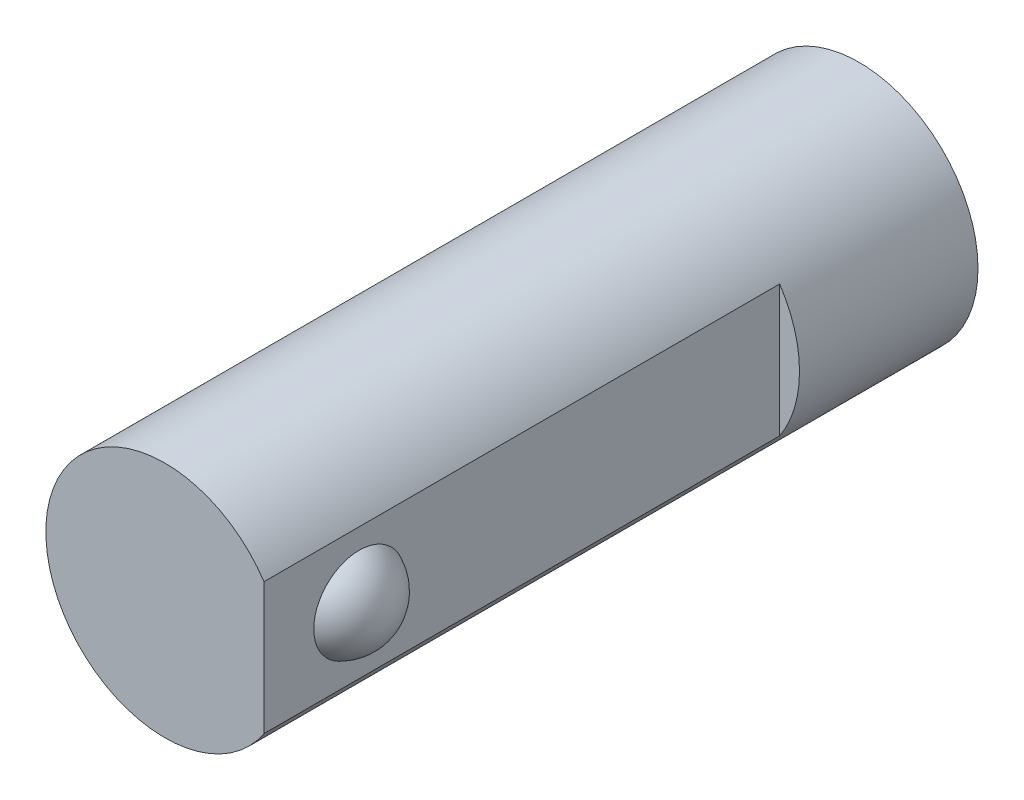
ISO-10303-21;
HEADER;
FILE_DESCRIPTION(('STEP AP214'),'2;1');
FILE_NAME('part.step','',(''),(''),'','','');
FILE_SCHEMA(('AUTOMOTIVE_DESIGN { 1 0 10303 214 1 1 1 1 }'));
ENDSEC;
DATA;
#1=APPLICATION_CONTEXT('core data for automotive mechanical design processes');
#2=APPLICATION_PROTOCOL_DEFINITION('international standard','automotive_design',2000,#1);
#3=PRODUCT_CONTEXT('',#1,'mechanical');
#4=PRODUCT('Part','Part','',(#3));
#5=PRODUCT_RELATED_PRODUCT_CATEGORY('part','',(#4));
#6=PRODUCT_DEFINITION_FORMATION('','',#4);
#7=PRODUCT_DEFINITION_CONTEXT('part definition',#1,'design');
#8=PRODUCT_DEFINITION('design','',#6,#7);
#9=PRODUCT_DEFINITION_SHAPE('','',#8);
#10=(LENGTH_UNIT() NAMED_UNIT(*) SI_UNIT(.MILLI.,.METRE.));
#11=(NAMED_UNIT(*) PLANE_ANGLE_UNIT() SI_UNIT($,.RADIAN.));
#12=(NAMED_UNIT(*) SI_UNIT($,.STERADIAN.) SOLID_ANGLE_UNIT());
#13=UNCERTAINTY_MEASURE_WITH_UNIT(LENGTH_MEASURE(1.E-05),#10,'distance_accuracy_value','');
#14=(GEOMETRIC_REPRESENTATION_CONTEXT(3) GLOBAL_UNCERTAINTY_ASSIGNED_CONTEXT((#13)) GLOBAL_UNIT_ASSIGNED_CONTEXT((#10,
#11,#12)) REPRESENTATION_CONTEXT('',''));
#15=CARTESIAN_POINT('',(0.,0.,0.));
#16=DIRECTION('',(0.,0.,1.));
#17=DIRECTION('',(1.,0.,0.));
#18=AXIS2_PLACEMENT_3D('',#15,#16,#17);
#19=CARTESIAN_POINT('',(0.,0.,0.));
#20=DIRECTION('',(0.,0.,1.));
#21=DIRECTION('',(1.,0.,0.));
#22=AXIS2_PLACEMENT_3D('',#19,#20,#21);
#23=CYLINDRICAL_SURFACE('',#22,6.);
#24=DIRECTION('',(0.,0.,1.));
#25=VECTOR('',#24,1.);
#26=CARTESIAN_POINT('',(5.,-3.3166247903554,9.));
#27=LINE('',#26,#25);
#28=CARTESIAN_POINT('',(5.,-3.3166247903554,9.));
#29=VERTEX_POINT('',#28);
#30=CARTESIAN_POINT('',(5.,-3.3166247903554,35.));
#31=VERTEX_POINT('',#30);
#32=EDGE_CURVE('E34',#29,#31,#27,.T.);
#33=ORIENTED_EDGE('',*,*,#32,.T.);
#34=CARTESIAN_POINT('',(0.,0.,35.));
#35=DIRECTION('',(0.,0.,1.));
#36=DIRECTION('',(1.,0.,0.));
#37=AXIS2_PLACEMENT_3D('',#34,#35,#36);
#38=CIRCLE('',#37,6.);
#39=CARTESIAN_POINT('',(5.,3.3166247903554,35.));
#40=VERTEX_POINT('',#39);
#41=EDGE_CURVE('E22',#40,#31,#38,.T.);
#42=ORIENTED_EDGE('',*,*,#41,.F.);
#43=DIRECTION('',(0.,0.,1.));
#44=VECTOR('',#43,1.);
#45=CARTESIAN_POINT('',(5.,3.31662479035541,9.));
#46=LINE('',#45,#44);
#47=CARTESIAN_POINT('',(5.,3.31662479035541,9.));
#48=VERTEX_POINT('',#47);
#49=EDGE_CURVE('E29',#48,#40,#46,.T.);
#50=ORIENTED_EDGE('',*,*,#49,.F.);
#51=CARTESIAN_POINT('',(0.,0.,9.));
#52=DIRECTION('',(0.,0.,1.));
#53=DIRECTION('',(1.,0.,0.));
#54=AXIS2_PLACEMENT_3D('',#51,#52,#53);
#55=CIRCLE('',#54,6.);
#56=EDGE_CURVE('E45',#29,#48,#55,.T.);
#57=ORIENTED_EDGE('',*,*,#56,.F.);
#58=EDGE_LOOP('',(#33,#42,#50,#57));
#59=FACE_BOUND('',#58,.T.);
#60=CARTESIAN_POINT('',(0.,0.,0.));
#61=DIRECTION('',(0.,0.,1.));
#62=DIRECTION('',(1.,0.,0.));
#63=AXIS2_PLACEMENT_3D('',#60,#61,#62);
#64=CIRCLE('',#63,6.);
#65=CARTESIAN_POINT('',(6.,0.,0.));
#66=VERTEX_POINT('',#65);
#67=EDGE_CURVE('E9',#66,#66,#64,.T.);
#68=ORIENTED_EDGE('',*,*,#67,.T.);
#69=EDGE_LOOP('',(#68));
#70=FACE_BOUND('',#69,.T.);
#71=ADVANCED_FACE('F14',(#59,#70),#23,.T.);
#72=CARTESIAN_POINT('',(0.,0.,0.));
#73=DIRECTION('',(0.,0.,1.));
#74=DIRECTION('',(1.,0.,0.));
#75=AXIS2_PLACEMENT_3D('',#72,#73,#74);
#76=PLANE('',#75);
#77=ORIENTED_EDGE('',*,*,#67,.F.);
#78=EDGE_LOOP('',(#77));
#79=FACE_BOUND('',#78,.T.);
#80=ADVANCED_FACE('F72',(#79),#76,.F.);
#81=CARTESIAN_POINT('',(0.,0.,35.));
#82=DIRECTION('',(0.,0.,1.));
#83=DIRECTION('',(1.,0.,0.));
#84=AXIS2_PLACEMENT_3D('',#81,#82,#83);
#85=PLANE('',#84);
#86=DIRECTION('',(0.,-1.,0.));
#87=VECTOR('',#86,1.);
#88=CARTESIAN_POINT('',(5.,3.31662479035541,35.));
#89=LINE('',#88,#87);
#90=EDGE_CURVE('E40',#40,#31,#89,.T.);
#91=ORIENTED_EDGE('',*,*,#90,.F.);
#92=ORIENTED_EDGE('',*,*,#41,.T.);
#93=EDGE_LOOP('',(#91,#92));
#94=FACE_BOUND('',#93,.T.);
#95=ADVANCED_FACE('F51',(#94),#85,.T.);
#96=CARTESIAN_POINT('',(5.,3.31662479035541,9.));
#97=DIRECTION('',(-1.,0.,0.));
#98=DIRECTION('',(0.,0.,1.));
#99=AXIS2_PLACEMENT_3D('',#96,#97,#98);
#100=PLANE('',#99);
#101=CARTESIAN_POINT('',(5.,0.,30.2));
#102=DIRECTION('',(-1.,0.,0.));
#103=DIRECTION('',(0.,0.,1.));
#104=AXIS2_PLACEMENT_3D('',#101,#102,#103);
#105=CIRCLE('',#104,2.29128784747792);
#106=CARTESIAN_POINT('',(5.,0.,32.4912878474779));
#107=VERTEX_POINT('',#106);
#108=EDGE_CURVE('E17',#107,#107,#105,.T.);
#109=ORIENTED_EDGE('',*,*,#108,.T.);
#110=EDGE_LOOP('',(#109));
#111=FACE_BOUND('',#110,.T.);
#112=ORIENTED_EDGE('',*,*,#90,.T.);
#113=ORIENTED_EDGE('',*,*,#32,.F.);
#114=DIRECTION('',(0.,-1.,0.));
#115=VECTOR('',#114,1.);
#116=CARTESIAN_POINT('',(5.,3.31662479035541,9.));
#117=LINE('',#116,#115);
#118=EDGE_CURVE('E54',#48,#29,#117,.T.);
#119=ORIENTED_EDGE('',*,*,#118,.F.);
#120=ORIENTED_EDGE('',*,*,#49,.T.);
#121=EDGE_LOOP('',(#112,#113,#119,#120));
#122=FACE_BOUND('',#121,.T.);
#123=ADVANCED_FACE('F41',(#111,#122),#100,.F.);
#124=CARTESIAN_POINT('',(0.,0.,9.));
#125=DIRECTION('',(0.,0.,1.));
#126=DIRECTION('',(1.,0.,0.));
#127=AXIS2_PLACEMENT_3D('',#124,#125,#126);
#128=PLANE('',#127);
#129=ORIENTED_EDGE('',*,*,#56,.T.);
#130=ORIENTED_EDGE('',*,*,#118,.T.);
#131=EDGE_LOOP('',(#129,#130));
#132=FACE_BOUND('',#131,.T.);
#133=ADVANCED_FACE('F58',(#132),#128,.T.);
#134=CARTESIAN_POINT('',(4.,0.,30.2));
#135=DIRECTION('',(0.,0.,1.));
#136=DIRECTION('',(0.,1.,0.));
#137=AXIS2_PLACEMENT_3D('',#134,#135,#136);
#138=SPHERICAL_SURFACE('',#137,2.5);
#139=CARTESIAN_POINT('',(4.,0.,30.2));
#140=DIRECTION('',(-1.,0.,0.));
#141=DIRECTION('',(0.,0.,1.));
#142=AXIS2_PLACEMENT_3D('',#139,#140,#141);
#143=SPHERICAL_SURFACE('',#142,2.5);
#144=ORIENTED_EDGE('',*,*,#108,.F.);
#145=EDGE_LOOP('',(#144));
#146=FACE_BOUND('',#145,.T.);
#147=ADVANCED_FACE('F60',(#146),#143,.T.);
#148=CLOSED_SHELL('',(#71,#80,#95,#123,#133,#147));
#149=MANIFOLD_SOLID_BREP('B1',#148);
#150=ADVANCED_BREP_SHAPE_REPRESENTATION('',(#18,#149),#14);
#151=SHAPE_DEFINITION_REPRESENTATION(#9,#150);
ENDSEC;
END-ISO-10303-21;
